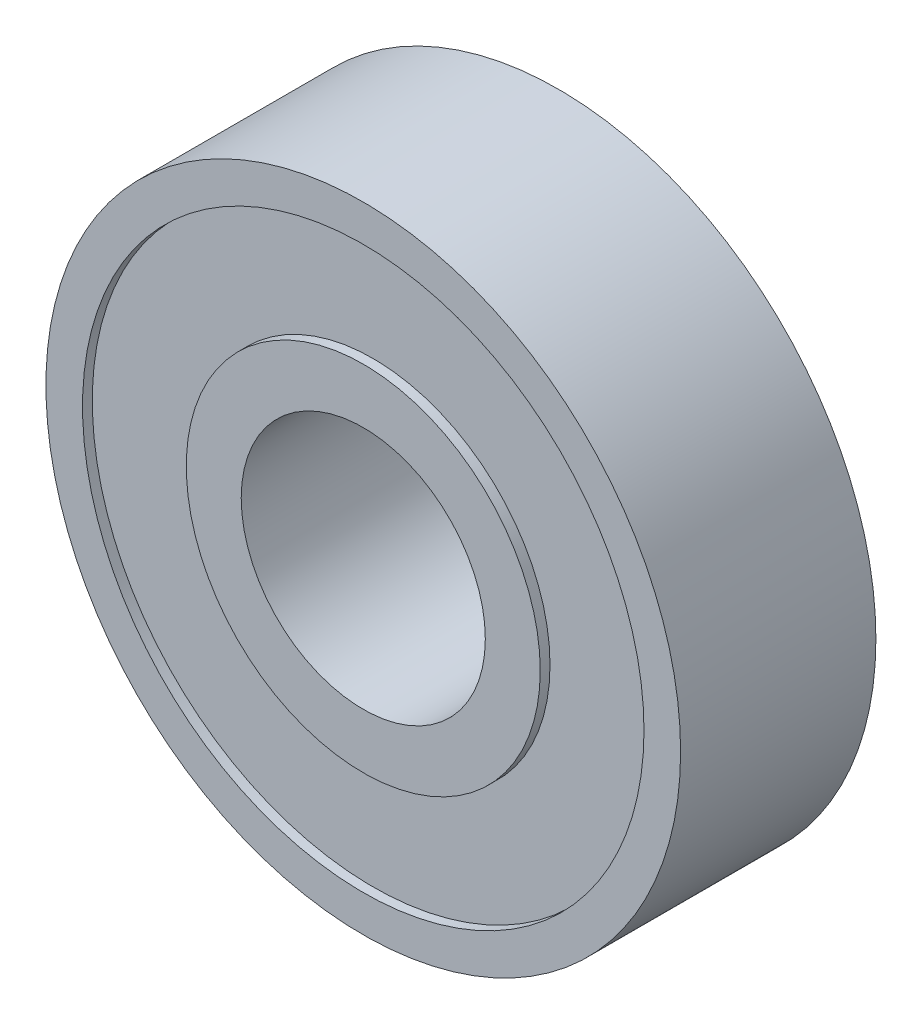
from build123d import *

# Parameters (mm, degrees)
SKETCH1_R          = 13
SKETCH1_R_2        = 5
EXTRUDE1_DEPTH     = 4
SKETCH2_R          = 11.5
SKETCH2_R_2        = 7.25
CUT_EXTRUDE1_DEPTH = 0.4


with BuildPart() as part:
    # Sketch1 → Extrude1 (new, symmetric)
    with BuildSketch(Plane.XY):
        Circle(SKETCH1_R)
        Circle(SKETCH1_R_2, mode=Mode.SUBTRACT)
    extrude(amount=EXTRUDE1_DEPTH, both=True)

    # Sketch2 → Cut-Extrude1 (cut)
    with BuildSketch(Plane.XY.offset(4)):
        Circle(SKETCH2_R)
        Circle(SKETCH2_R_2, mode=Mode.SUBTRACT)
    cut_extrude1 = extrude(amount=-CUT_EXTRUDE1_DEPTH, mode=Mode.SUBTRACT)

    # Mirror1: Cut-Extrude1 across plane
    add(cut_extrude1.mirror(Plane.XY), mode=Mode.SUBTRACT)


solid = part.part
